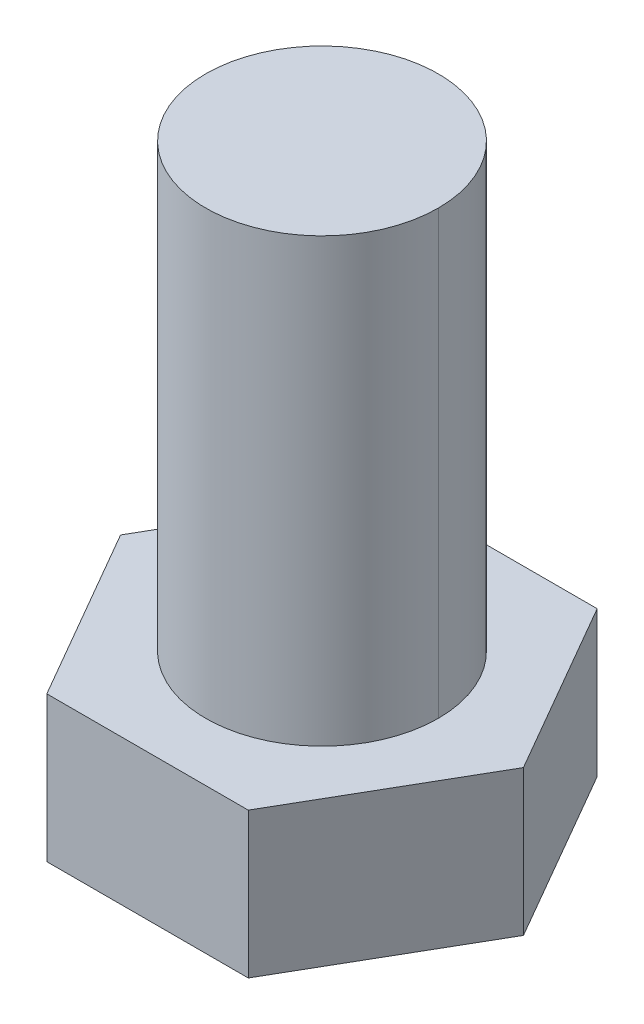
ISO-10303-21;
HEADER;
FILE_DESCRIPTION(('STEP AP214'),'2;1');
FILE_NAME('part.step','',(''),(''),'','','');
FILE_SCHEMA(('AUTOMOTIVE_DESIGN { 1 0 10303 214 1 1 1 1 }'));
ENDSEC;
DATA;
#1=APPLICATION_CONTEXT('core data for automotive mechanical design processes');
#2=APPLICATION_PROTOCOL_DEFINITION('international standard','automotive_design',2000,#1);
#3=PRODUCT_CONTEXT('',#1,'mechanical');
#4=PRODUCT('Part','Part','',(#3));
#5=PRODUCT_RELATED_PRODUCT_CATEGORY('part','',(#4));
#6=PRODUCT_DEFINITION_FORMATION('','',#4);
#7=PRODUCT_DEFINITION_CONTEXT('part definition',#1,'design');
#8=PRODUCT_DEFINITION('design','',#6,#7);
#9=PRODUCT_DEFINITION_SHAPE('','',#8);
#10=(LENGTH_UNIT() NAMED_UNIT(*) SI_UNIT(.MILLI.,.METRE.));
#11=(NAMED_UNIT(*) PLANE_ANGLE_UNIT() SI_UNIT($,.RADIAN.));
#12=(NAMED_UNIT(*) SI_UNIT($,.STERADIAN.) SOLID_ANGLE_UNIT());
#13=UNCERTAINTY_MEASURE_WITH_UNIT(LENGTH_MEASURE(1.E-05),#10,'distance_accuracy_value','');
#14=(GEOMETRIC_REPRESENTATION_CONTEXT(3) GLOBAL_UNCERTAINTY_ASSIGNED_CONTEXT((#13)) GLOBAL_UNIT_ASSIGNED_CONTEXT((#10,
#11,#12)) REPRESENTATION_CONTEXT('',''));
#15=CARTESIAN_POINT('',(0.,0.,0.));
#16=DIRECTION('',(0.,0.,1.));
#17=DIRECTION('',(1.,0.,0.));
#18=AXIS2_PLACEMENT_3D('',#15,#16,#17);
#19=CARTESIAN_POINT('',(-5.49926131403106,-16.0337499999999,9.525));
#20=DIRECTION('',(0.,1.,0.));
#21=DIRECTION('',(0.,0.,1.));
#22=AXIS2_PLACEMENT_3D('',#19,#20,#21);
#23=PLANE('',#22);
#24=DIRECTION('',(0.500000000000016,0.,0.866025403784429));
#25=VECTOR('',#24,1.);
#26=CARTESIAN_POINT('',(-10.9985226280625,-16.0337499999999,0.));
#27=LINE('',#26,#25);
#28=CARTESIAN_POINT('',(-10.9985226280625,-16.0337499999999,0.));
#29=VERTEX_POINT('',#28);
#30=CARTESIAN_POINT('',(-5.49926131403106,-16.0337499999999,9.525));
#31=VERTEX_POINT('',#30);
#32=EDGE_CURVE('E138',#29,#31,#27,.T.);
#33=ORIENTED_EDGE('',*,*,#32,.F.);
#34=DIRECTION('',(-0.500000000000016,0.,0.866025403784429));
#35=VECTOR('',#34,1.);
#36=CARTESIAN_POINT('',(-5.49926131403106,-16.0337499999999,-9.525));
#37=LINE('',#36,#35);
#38=CARTESIAN_POINT('',(-5.49926131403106,-16.0337499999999,-9.525));
#39=VERTEX_POINT('',#38);
#40=EDGE_CURVE('E115',#39,#29,#37,.T.);
#41=ORIENTED_EDGE('',*,*,#40,.F.);
#42=DIRECTION('',(-1.,0.,0.));
#43=VECTOR('',#42,1.);
#44=CARTESIAN_POINT('',(5.49926131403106,-16.0337499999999,-9.525));
#45=LINE('',#44,#43);
#46=CARTESIAN_POINT('',(5.49926131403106,-16.0337499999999,-9.525));
#47=VERTEX_POINT('',#46);
#48=EDGE_CURVE('E86',#47,#39,#45,.T.);
#49=ORIENTED_EDGE('',*,*,#48,.F.);
#50=DIRECTION('',(-0.500000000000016,0.,-0.866025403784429));
#51=VECTOR('',#50,1.);
#52=CARTESIAN_POINT('',(10.9985226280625,-16.0337499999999,0.));
#53=LINE('',#52,#51);
#54=CARTESIAN_POINT('',(10.9985226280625,-16.0337499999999,0.));
#55=VERTEX_POINT('',#54);
#56=EDGE_CURVE('E123',#55,#47,#53,.T.);
#57=ORIENTED_EDGE('',*,*,#56,.F.);
#58=DIRECTION('',(0.500000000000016,0.,-0.866025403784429));
#59=VECTOR('',#58,1.);
#60=CARTESIAN_POINT('',(5.49926131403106,-16.0337499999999,9.525));
#61=LINE('',#60,#59);
#62=CARTESIAN_POINT('',(5.49926131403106,-16.0337499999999,9.525));
#63=VERTEX_POINT('',#62);
#64=EDGE_CURVE('E129',#63,#55,#61,.T.);
#65=ORIENTED_EDGE('',*,*,#64,.F.);
#66=DIRECTION('',(1.,0.,0.));
#67=VECTOR('',#66,1.);
#68=CARTESIAN_POINT('',(-5.49926131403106,-16.0337499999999,9.525));
#69=LINE('',#68,#67);
#70=EDGE_CURVE('E135',#31,#63,#69,.T.);
#71=ORIENTED_EDGE('',*,*,#70,.F.);
#72=EDGE_LOOP('',(#33,#41,#49,#57,#65,#71));
#73=FACE_BOUND('',#72,.T.);
#74=ADVANCED_FACE('F16',(#73),#23,.F.);
#75=CARTESIAN_POINT('',(-10.9985226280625,-8.09624999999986,0.));
#76=DIRECTION('',(-0.866025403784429,0.,0.500000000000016));
#77=DIRECTION('',(0.500000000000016,0.,0.866025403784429));
#78=AXIS2_PLACEMENT_3D('',#75,#76,#77);
#79=PLANE('',#78);
#80=DIRECTION('',(0.500000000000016,0.,0.866025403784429));
#81=VECTOR('',#80,1.);
#82=CARTESIAN_POINT('',(-10.9985226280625,-8.09624999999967,0.));
#83=LINE('',#82,#81);
#84=CARTESIAN_POINT('',(-10.9985226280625,-8.09624999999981,0.));
#85=VERTEX_POINT('',#84);
#86=CARTESIAN_POINT('',(-5.49926131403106,-8.09624999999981,9.525));
#87=VERTEX_POINT('',#86);
#88=EDGE_CURVE('E89',#85,#87,#83,.T.);
#89=ORIENTED_EDGE('',*,*,#88,.F.);
#90=DIRECTION('',(0.,1.,0.));
#91=VECTOR('',#90,1.);
#92=CARTESIAN_POINT('',(-10.9985226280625,-8.09624999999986,0.));
#93=LINE('',#92,#91);
#94=EDGE_CURVE('E90',#29,#85,#93,.T.);
#95=ORIENTED_EDGE('',*,*,#94,.F.);
#96=ORIENTED_EDGE('',*,*,#32,.T.);
#97=DIRECTION('',(0.,1.,0.));
#98=VECTOR('',#97,1.);
#99=CARTESIAN_POINT('',(-5.49926131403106,-8.09624999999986,9.525));
#100=LINE('',#99,#98);
#101=EDGE_CURVE('E132',#87,#31,#100,.F.);
#102=ORIENTED_EDGE('',*,*,#101,.F.);
#103=EDGE_LOOP('',(#89,#95,#96,#102));
#104=FACE_BOUND('',#103,.T.);
#105=ADVANCED_FACE('F180',(#104),#79,.T.);
#106=CARTESIAN_POINT('',(-5.49926131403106,-8.09624999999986,9.525));
#107=DIRECTION('',(0.,0.,1.));
#108=DIRECTION('',(1.,0.,0.));
#109=AXIS2_PLACEMENT_3D('',#106,#107,#108);
#110=PLANE('',#109);
#111=DIRECTION('',(1.,0.,0.));
#112=VECTOR('',#111,1.);
#113=CARTESIAN_POINT('',(0.,-8.09624999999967,9.525));
#114=LINE('',#113,#112);
#115=CARTESIAN_POINT('',(5.49926131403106,-8.09624999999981,9.525));
#116=VERTEX_POINT('',#115);
#117=EDGE_CURVE('E110',#87,#116,#114,.T.);
#118=ORIENTED_EDGE('',*,*,#117,.F.);
#119=ORIENTED_EDGE('',*,*,#101,.T.);
#120=ORIENTED_EDGE('',*,*,#70,.T.);
#121=DIRECTION('',(0.,1.,0.));
#122=VECTOR('',#121,1.);
#123=CARTESIAN_POINT('',(5.49926131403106,-8.09624999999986,9.525));
#124=LINE('',#123,#122);
#125=EDGE_CURVE('E126',#116,#63,#124,.F.);
#126=ORIENTED_EDGE('',*,*,#125,.F.);
#127=EDGE_LOOP('',(#118,#119,#120,#126));
#128=FACE_BOUND('',#127,.T.);
#129=ADVANCED_FACE('F177',(#128),#110,.T.);
#130=CARTESIAN_POINT('',(5.49926131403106,-8.09624999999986,9.525));
#131=DIRECTION('',(0.866025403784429,0.,0.500000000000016));
#132=DIRECTION('',(0.500000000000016,0.,-0.866025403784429));
#133=AXIS2_PLACEMENT_3D('',#130,#131,#132);
#134=PLANE('',#133);
#135=DIRECTION('',(0.500000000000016,0.,-0.866025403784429));
#136=VECTOR('',#135,1.);
#137=CARTESIAN_POINT('',(5.49926131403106,-8.09624999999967,9.525));
#138=LINE('',#137,#136);
#139=CARTESIAN_POINT('',(10.9985226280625,-8.09624999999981,0.));
#140=VERTEX_POINT('',#139);
#141=EDGE_CURVE('E105',#116,#140,#138,.T.);
#142=ORIENTED_EDGE('',*,*,#141,.F.);
#143=ORIENTED_EDGE('',*,*,#125,.T.);
#144=ORIENTED_EDGE('',*,*,#64,.T.);
#145=DIRECTION('',(0.,1.,0.));
#146=VECTOR('',#145,1.);
#147=CARTESIAN_POINT('',(10.9985226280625,-8.09624999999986,0.));
#148=LINE('',#147,#146);
#149=EDGE_CURVE('E120',#140,#55,#148,.F.);
#150=ORIENTED_EDGE('',*,*,#149,.F.);
#151=EDGE_LOOP('',(#142,#143,#144,#150));
#152=FACE_BOUND('',#151,.T.);
#153=ADVANCED_FACE('F173',(#152),#134,.T.);
#154=CARTESIAN_POINT('',(10.9985226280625,-8.09624999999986,0.));
#155=DIRECTION('',(0.866025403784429,0.,-0.500000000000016));
#156=DIRECTION('',(-0.500000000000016,0.,-0.866025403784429));
#157=AXIS2_PLACEMENT_3D('',#154,#155,#156);
#158=PLANE('',#157);
#159=DIRECTION('',(-0.500000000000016,0.,-0.866025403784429));
#160=VECTOR('',#159,1.);
#161=CARTESIAN_POINT('',(10.9985226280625,-8.09624999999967,0.));
#162=LINE('',#161,#160);
#163=CARTESIAN_POINT('',(5.49926131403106,-8.09624999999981,-9.525));
#164=VERTEX_POINT('',#163);
#165=EDGE_CURVE('E103',#140,#164,#162,.T.);
#166=ORIENTED_EDGE('',*,*,#165,.F.);
#167=ORIENTED_EDGE('',*,*,#149,.T.);
#168=ORIENTED_EDGE('',*,*,#56,.T.);
#169=DIRECTION('',(0.,1.,0.));
#170=VECTOR('',#169,1.);
#171=CARTESIAN_POINT('',(5.49926131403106,-8.09624999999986,-9.525));
#172=LINE('',#171,#170);
#173=EDGE_CURVE('E117',#164,#47,#172,.F.);
#174=ORIENTED_EDGE('',*,*,#173,.F.);
#175=EDGE_LOOP('',(#166,#167,#168,#174));
#176=FACE_BOUND('',#175,.T.);
#177=ADVANCED_FACE('F170',(#176),#158,.T.);
#178=CARTESIAN_POINT('',(5.49926131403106,-8.09624999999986,-9.525));
#179=DIRECTION('',(0.,0.,-1.));
#180=DIRECTION('',(-1.,0.,0.));
#181=AXIS2_PLACEMENT_3D('',#178,#179,#180);
#182=PLANE('',#181);
#183=DIRECTION('',(1.,0.,0.));
#184=VECTOR('',#183,1.);
#185=CARTESIAN_POINT('',(0.,-8.09624999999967,-9.525));
#186=LINE('',#185,#184);
#187=CARTESIAN_POINT('',(-5.49926131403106,-8.09624999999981,-9.525));
#188=VERTEX_POINT('',#187);
#189=EDGE_CURVE('E84',#164,#188,#186,.F.);
#190=ORIENTED_EDGE('',*,*,#189,.F.);
#191=ORIENTED_EDGE('',*,*,#173,.T.);
#192=ORIENTED_EDGE('',*,*,#48,.T.);
#193=DIRECTION('',(0.,1.,0.));
#194=VECTOR('',#193,1.);
#195=CARTESIAN_POINT('',(-5.49926131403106,-8.09624999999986,-9.525));
#196=LINE('',#195,#194);
#197=EDGE_CURVE('E79',#188,#39,#196,.F.);
#198=ORIENTED_EDGE('',*,*,#197,.F.);
#199=EDGE_LOOP('',(#190,#191,#192,#198));
#200=FACE_BOUND('',#199,.T.);
#201=ADVANCED_FACE('F81',(#200),#182,.T.);
#202=CARTESIAN_POINT('',(-5.49926131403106,-8.09624999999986,-9.525));
#203=DIRECTION('',(-0.866025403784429,0.,-0.500000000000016));
#204=DIRECTION('',(-0.500000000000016,0.,0.866025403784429));
#205=AXIS2_PLACEMENT_3D('',#202,#203,#204);
#206=PLANE('',#205);
#207=DIRECTION('',(-0.500000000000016,0.,0.866025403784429));
#208=VECTOR('',#207,1.);
#209=CARTESIAN_POINT('',(-5.49926131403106,-8.09624999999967,-9.525));
#210=LINE('',#209,#208);
#211=EDGE_CURVE('E94',#188,#85,#210,.T.);
#212=ORIENTED_EDGE('',*,*,#211,.F.);
#213=ORIENTED_EDGE('',*,*,#197,.T.);
#214=ORIENTED_EDGE('',*,*,#40,.T.);
#215=ORIENTED_EDGE('',*,*,#94,.T.);
#216=EDGE_LOOP('',(#212,#213,#214,#215));
#217=FACE_BOUND('',#216,.T.);
#218=ADVANCED_FACE('F95',(#217),#206,.T.);
#219=CARTESIAN_POINT('',(0.,-8.09624999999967,0.));
#220=DIRECTION('',(0.,1.,0.));
#221=DIRECTION('',(0.,0.,1.));
#222=AXIS2_PLACEMENT_3D('',#219,#220,#221);
#223=PLANE('',#222);
#224=CARTESIAN_POINT('',(0.,-8.09625000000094,0.));
#225=DIRECTION('',(0.,-1.,0.));
#226=DIRECTION('',(0.,0.,-1.));
#227=AXIS2_PLACEMENT_3D('',#224,#225,#226);
#228=CIRCLE('',#227,6.35);
#229=CARTESIAN_POINT('',(6.35,-8.09625000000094,0.));
#230=VERTEX_POINT('',#229);
#231=CARTESIAN_POINT('',(-6.35,-8.09625000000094,0.));
#232=VERTEX_POINT('',#231);
#233=EDGE_CURVE('E141',#230,#232,#228,.F.);
#234=ORIENTED_EDGE('',*,*,#233,.F.);
#235=CARTESIAN_POINT('',(0.,-8.09625000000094,0.));
#236=DIRECTION('',(0.,-1.,0.));
#237=DIRECTION('',(0.,0.,-1.));
#238=AXIS2_PLACEMENT_3D('',#235,#236,#237);
#239=CIRCLE('',#238,6.35);
#240=EDGE_CURVE('E19',#232,#230,#239,.F.);
#241=ORIENTED_EDGE('',*,*,#240,.F.);
#242=EDGE_LOOP('',(#234,#241));
#243=FACE_BOUND('',#242,.T.);
#244=ORIENTED_EDGE('',*,*,#189,.T.);
#245=ORIENTED_EDGE('',*,*,#211,.T.);
#246=ORIENTED_EDGE('',*,*,#88,.T.);
#247=ORIENTED_EDGE('',*,*,#117,.T.);
#248=ORIENTED_EDGE('',*,*,#141,.T.);
#249=ORIENTED_EDGE('',*,*,#165,.T.);
#250=EDGE_LOOP('',(#244,#245,#246,#247,#248,#249));
#251=FACE_BOUND('',#250,.T.);
#252=ADVANCED_FACE('F100',(#243,#251),#223,.T.);
#253=CARTESIAN_POINT('',(0.,9.68374999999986,0.));
#254=DIRECTION('',(0.,-1.,0.));
#255=DIRECTION('',(0.,0.,-1.));
#256=AXIS2_PLACEMENT_3D('',#253,#254,#255);
#257=CYLINDRICAL_SURFACE('',#256,6.35);
#258=DIRECTION('',(0.,-1.,0.));
#259=VECTOR('',#258,1.);
#260=CARTESIAN_POINT('',(-6.35,9.68374999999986,0.));
#261=LINE('',#260,#259);
#262=CARTESIAN_POINT('',(-6.35,16.0337499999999,0.));
#263=VERTEX_POINT('',#262);
#264=EDGE_CURVE('E25',#232,#263,#261,.F.);
#265=ORIENTED_EDGE('',*,*,#264,.F.);
#266=ORIENTED_EDGE('',*,*,#240,.T.);
#267=DIRECTION('',(0.,-1.,0.));
#268=VECTOR('',#267,1.);
#269=CARTESIAN_POINT('',(6.35,9.68374999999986,0.));
#270=LINE('',#269,#268);
#271=CARTESIAN_POINT('',(6.35,16.0337499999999,0.));
#272=VERTEX_POINT('',#271);
#273=EDGE_CURVE('E143',#272,#230,#270,.T.);
#274=ORIENTED_EDGE('',*,*,#273,.F.);
#275=CARTESIAN_POINT('',(0.,16.0337499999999,0.));
#276=DIRECTION('',(0.,-1.,0.));
#277=DIRECTION('',(0.,0.,-1.));
#278=AXIS2_PLACEMENT_3D('',#275,#276,#277);
#279=CIRCLE('',#278,6.35);
#280=EDGE_CURVE('E34',#272,#263,#279,.T.);
#281=ORIENTED_EDGE('',*,*,#280,.T.);
#282=EDGE_LOOP('',(#265,#266,#274,#281));
#283=FACE_BOUND('',#282,.T.);
#284=ADVANCED_FACE('F147',(#283),#257,.T.);
#285=CARTESIAN_POINT('',(0.,16.0337499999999,0.));
#286=DIRECTION('',(0.,-1.,0.));
#287=DIRECTION('',(0.,0.,-1.));
#288=AXIS2_PLACEMENT_3D('',#285,#286,#287);
#289=PLANE('',#288);
#290=ORIENTED_EDGE('',*,*,#280,.F.);
#291=CARTESIAN_POINT('',(0.,16.0337499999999,0.));
#292=DIRECTION('',(0.,-1.,0.));
#293=DIRECTION('',(0.,0.,-1.));
#294=AXIS2_PLACEMENT_3D('',#291,#292,#293);
#295=CIRCLE('',#294,6.35);
#296=EDGE_CURVE('E11',#263,#272,#295,.T.);
#297=ORIENTED_EDGE('',*,*,#296,.F.);
#298=EDGE_LOOP('',(#290,#297));
#299=FACE_BOUND('',#298,.T.);
#300=ADVANCED_FACE('F153',(#299),#289,.F.);
#301=CARTESIAN_POINT('',(0.,9.68374999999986,0.));
#302=DIRECTION('',(0.,-1.,0.));
#303=DIRECTION('',(0.,0.,-1.));
#304=AXIS2_PLACEMENT_3D('',#301,#302,#303);
#305=CYLINDRICAL_SURFACE('',#304,6.35);
#306=ORIENTED_EDGE('',*,*,#264,.T.);
#307=ORIENTED_EDGE('',*,*,#296,.T.);
#308=ORIENTED_EDGE('',*,*,#273,.T.);
#309=ORIENTED_EDGE('',*,*,#233,.T.);
#310=EDGE_LOOP('',(#306,#307,#308,#309));
#311=FACE_BOUND('',#310,.T.);
#312=ADVANCED_FACE('F151',(#311),#305,.T.);
#313=CLOSED_SHELL('',(#74,#105,#129,#153,#177,#201,#218,#252,#284,#300,#312));
#314=MANIFOLD_SOLID_BREP('B1',#313);
#315=ADVANCED_BREP_SHAPE_REPRESENTATION('',(#18,#314),#14);
#316=SHAPE_DEFINITION_REPRESENTATION(#9,#315);
ENDSEC;
END-ISO-10303-21;
